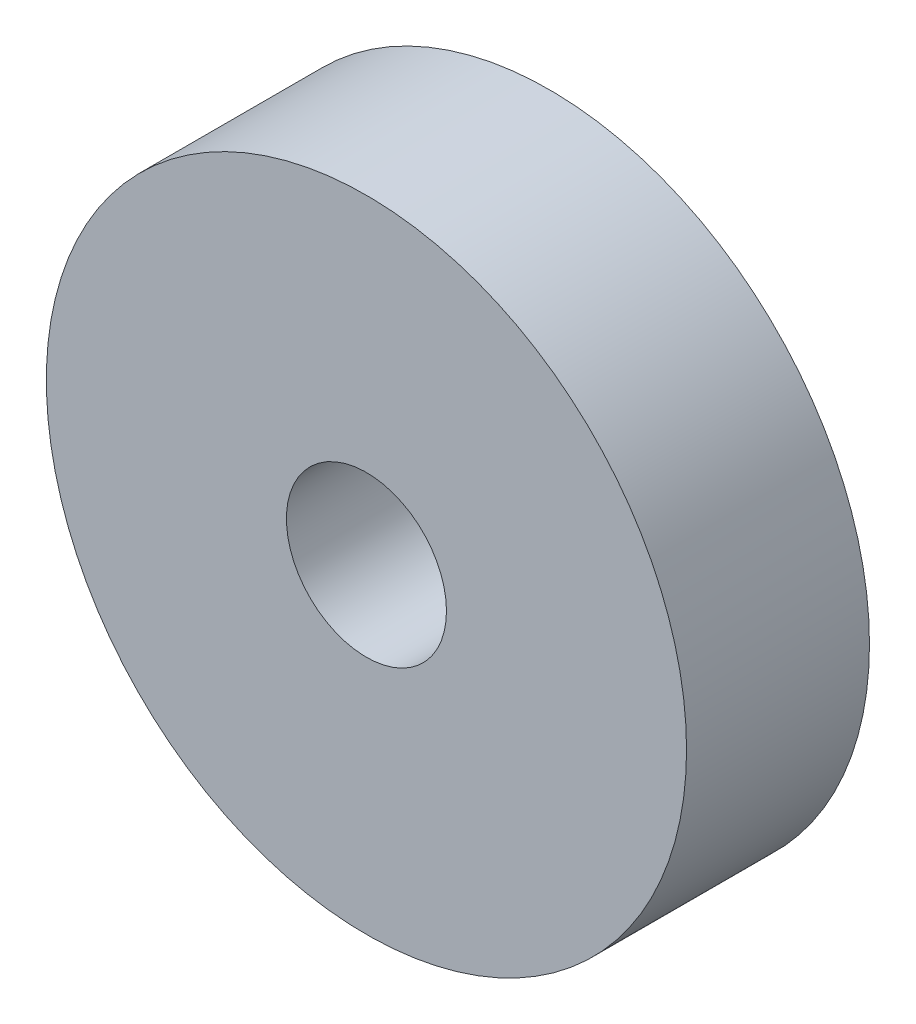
from build123d import *

# Parameters (mm, degrees)
SKETCH1_R      = 7
SKETCH1_R_2    = 1.75
EXTRUDE1_DEPTH = 4


with BuildPart() as part:
    # Sketch1 → Extrude1 (new body)
    with BuildSketch(Plane.XY):
        Circle(SKETCH1_R)
        Circle(SKETCH1_R_2, mode=Mode.SUBTRACT)
    extrude(amount=EXTRUDE1_DEPTH)


solid = part.part
